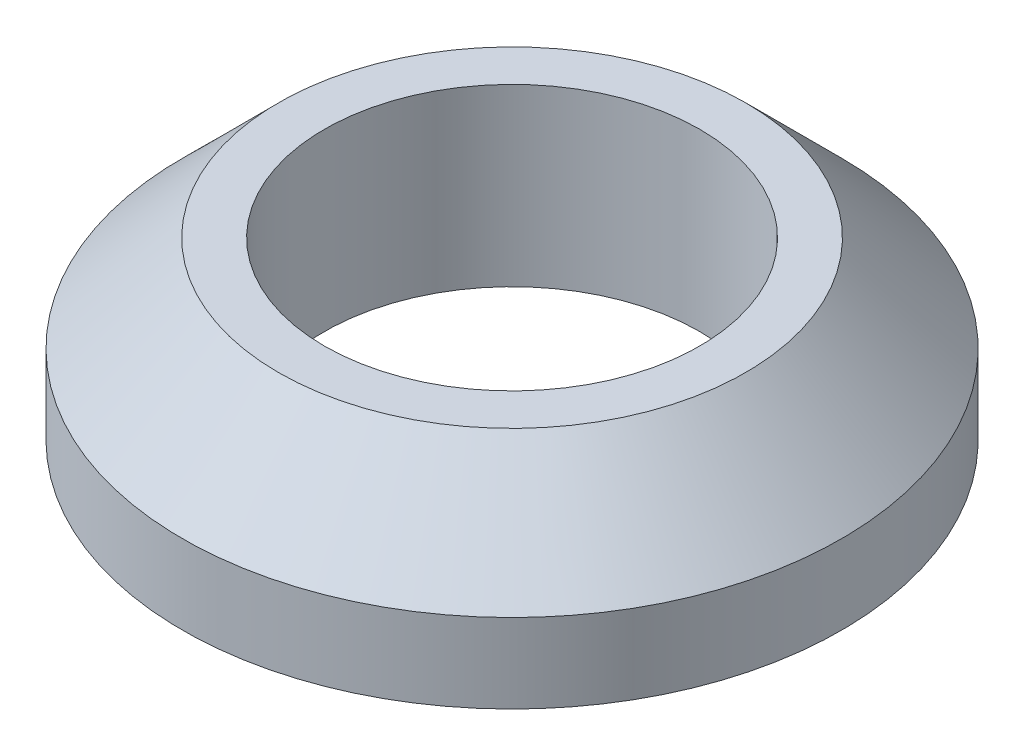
ISO-10303-21;
HEADER;
FILE_DESCRIPTION(('STEP AP214'),'2;1');
FILE_NAME('part.step','',(''),(''),'','','');
FILE_SCHEMA(('AUTOMOTIVE_DESIGN { 1 0 10303 214 1 1 1 1 }'));
ENDSEC;
DATA;
#1=APPLICATION_CONTEXT('core data for automotive mechanical design processes');
#2=APPLICATION_PROTOCOL_DEFINITION('international standard','automotive_design',2000,#1);
#3=PRODUCT_CONTEXT('',#1,'mechanical');
#4=PRODUCT('Part','Part','',(#3));
#5=PRODUCT_RELATED_PRODUCT_CATEGORY('part','',(#4));
#6=PRODUCT_DEFINITION_FORMATION('','',#4);
#7=PRODUCT_DEFINITION_CONTEXT('part definition',#1,'design');
#8=PRODUCT_DEFINITION('design','',#6,#7);
#9=PRODUCT_DEFINITION_SHAPE('','',#8);
#10=(LENGTH_UNIT() NAMED_UNIT(*) SI_UNIT(.MILLI.,.METRE.));
#11=(NAMED_UNIT(*) PLANE_ANGLE_UNIT() SI_UNIT($,.RADIAN.));
#12=(NAMED_UNIT(*) SI_UNIT($,.STERADIAN.) SOLID_ANGLE_UNIT());
#13=UNCERTAINTY_MEASURE_WITH_UNIT(LENGTH_MEASURE(1.E-05),#10,'distance_accuracy_value','');
#14=(GEOMETRIC_REPRESENTATION_CONTEXT(3) GLOBAL_UNCERTAINTY_ASSIGNED_CONTEXT((#13)) GLOBAL_UNIT_ASSIGNED_CONTEXT((#10,
#11,#12)) REPRESENTATION_CONTEXT('',''));
#15=CARTESIAN_POINT('',(0.,0.,0.));
#16=DIRECTION('',(0.,0.,1.));
#17=DIRECTION('',(1.,0.,0.));
#18=AXIS2_PLACEMENT_3D('',#15,#16,#17);
#19=CARTESIAN_POINT('',(7.9,0.,0.));
#20=DIRECTION('',(0.,-1.,0.));
#21=DIRECTION('',(0.,0.,-1.));
#22=AXIS2_PLACEMENT_3D('',#19,#20,#21);
#23=PLANE('',#22);
#24=CARTESIAN_POINT('',(0.,0.,0.));
#25=DIRECTION('',(0.,-1.,0.));
#26=DIRECTION('',(0.,0.,-1.));
#27=AXIS2_PLACEMENT_3D('',#24,#25,#26);
#28=CIRCLE('',#27,7.9);
#29=CARTESIAN_POINT('',(0.,0.,-7.9));
#30=VERTEX_POINT('',#29);
#31=EDGE_CURVE('E31',#30,#30,#28,.T.);
#32=ORIENTED_EDGE('',*,*,#31,.T.);
#33=EDGE_LOOP('',(#32));
#34=FACE_BOUND('',#33,.T.);
#35=CARTESIAN_POINT('',(0.,0.,0.));
#36=DIRECTION('',(0.,-1.,0.));
#37=DIRECTION('',(0.,0.,-1.));
#38=AXIS2_PLACEMENT_3D('',#35,#36,#37);
#39=CIRCLE('',#38,4.5);
#40=CARTESIAN_POINT('',(0.,0.,-4.5));
#41=VERTEX_POINT('',#40);
#42=EDGE_CURVE('E8',#41,#41,#39,.T.);
#43=ORIENTED_EDGE('',*,*,#42,.F.);
#44=EDGE_LOOP('',(#43));
#45=FACE_BOUND('',#44,.T.);
#46=ADVANCED_FACE('F12',(#34,#45),#23,.T.);
#47=CARTESIAN_POINT('',(0.,0.,0.));
#48=DIRECTION('',(0.,-1.,0.));
#49=DIRECTION('',(0.,0.,-1.));
#50=AXIS2_PLACEMENT_3D('',#47,#48,#49);
#51=CYLINDRICAL_SURFACE('',#50,4.5);
#52=ORIENTED_EDGE('',*,*,#42,.T.);
#53=EDGE_LOOP('',(#52));
#54=FACE_BOUND('',#53,.T.);
#55=CARTESIAN_POINT('',(0.,4.2,0.));
#56=DIRECTION('',(0.,-1.,0.));
#57=DIRECTION('',(0.,0.,-1.));
#58=AXIS2_PLACEMENT_3D('',#55,#56,#57);
#59=CIRCLE('',#58,4.5);
#60=CARTESIAN_POINT('',(0.,4.2,-4.5));
#61=VERTEX_POINT('',#60);
#62=EDGE_CURVE('E18',#61,#61,#59,.T.);
#63=ORIENTED_EDGE('',*,*,#62,.F.);
#64=EDGE_LOOP('',(#63));
#65=FACE_BOUND('',#64,.T.);
#66=ADVANCED_FACE('F51',(#54,#65),#51,.F.);
#67=CARTESIAN_POINT('',(4.5,4.2,0.));
#68=DIRECTION('',(0.,1.,0.));
#69=DIRECTION('',(0.,0.,1.));
#70=AXIS2_PLACEMENT_3D('',#67,#68,#69);
#71=PLANE('',#70);
#72=ORIENTED_EDGE('',*,*,#62,.T.);
#73=EDGE_LOOP('',(#72));
#74=FACE_BOUND('',#73,.T.);
#75=CARTESIAN_POINT('',(0.,4.2,0.));
#76=DIRECTION('',(0.,-1.,0.));
#77=DIRECTION('',(0.,0.,-1.));
#78=AXIS2_PLACEMENT_3D('',#75,#76,#77);
#79=CIRCLE('',#78,5.6);
#80=CARTESIAN_POINT('',(0.,4.2,-5.6));
#81=VERTEX_POINT('',#80);
#82=EDGE_CURVE('E22',#81,#81,#79,.T.);
#83=ORIENTED_EDGE('',*,*,#82,.F.);
#84=EDGE_LOOP('',(#83));
#85=FACE_BOUND('',#84,.T.);
#86=ADVANCED_FACE('F47',(#74,#85),#71,.T.);
#87=CARTESIAN_POINT('',(0.,1.9,0.));
#88=DIRECTION('',(0.,-1.,0.));
#89=DIRECTION('',(0.,0.,-1.));
#90=AXIS2_PLACEMENT_3D('',#87,#88,#89);
#91=CONICAL_SURFACE('',#90,7.9,0.785398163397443);
#92=ORIENTED_EDGE('',*,*,#82,.T.);
#93=EDGE_LOOP('',(#92));
#94=FACE_BOUND('',#93,.T.);
#95=CARTESIAN_POINT('',(0.,1.9,0.));
#96=DIRECTION('',(0.,-1.,0.));
#97=DIRECTION('',(0.,0.,-1.));
#98=AXIS2_PLACEMENT_3D('',#95,#96,#97);
#99=CIRCLE('',#98,7.9);
#100=CARTESIAN_POINT('',(0.,1.9,-7.9));
#101=VERTEX_POINT('',#100);
#102=EDGE_CURVE('E26',#101,#101,#99,.T.);
#103=ORIENTED_EDGE('',*,*,#102,.F.);
#104=EDGE_LOOP('',(#103));
#105=FACE_BOUND('',#104,.T.);
#106=ADVANCED_FACE('F39',(#94,#105),#91,.T.);
#107=CARTESIAN_POINT('',(0.,0.,0.));
#108=DIRECTION('',(0.,-1.,0.));
#109=DIRECTION('',(0.,0.,-1.));
#110=AXIS2_PLACEMENT_3D('',#107,#108,#109);
#111=CYLINDRICAL_SURFACE('',#110,7.9);
#112=ORIENTED_EDGE('',*,*,#102,.T.);
#113=EDGE_LOOP('',(#112));
#114=FACE_BOUND('',#113,.T.);
#115=ORIENTED_EDGE('',*,*,#31,.F.);
#116=EDGE_LOOP('',(#115));
#117=FACE_BOUND('',#116,.T.);
#118=ADVANCED_FACE('F37',(#114,#117),#111,.T.);
#119=CLOSED_SHELL('',(#46,#66,#86,#106,#118));
#120=MANIFOLD_SOLID_BREP('B1',#119);
#121=ADVANCED_BREP_SHAPE_REPRESENTATION('',(#18,#120),#14);
#122=SHAPE_DEFINITION_REPRESENTATION(#9,#121);
ENDSEC;
END-ISO-10303-21;
